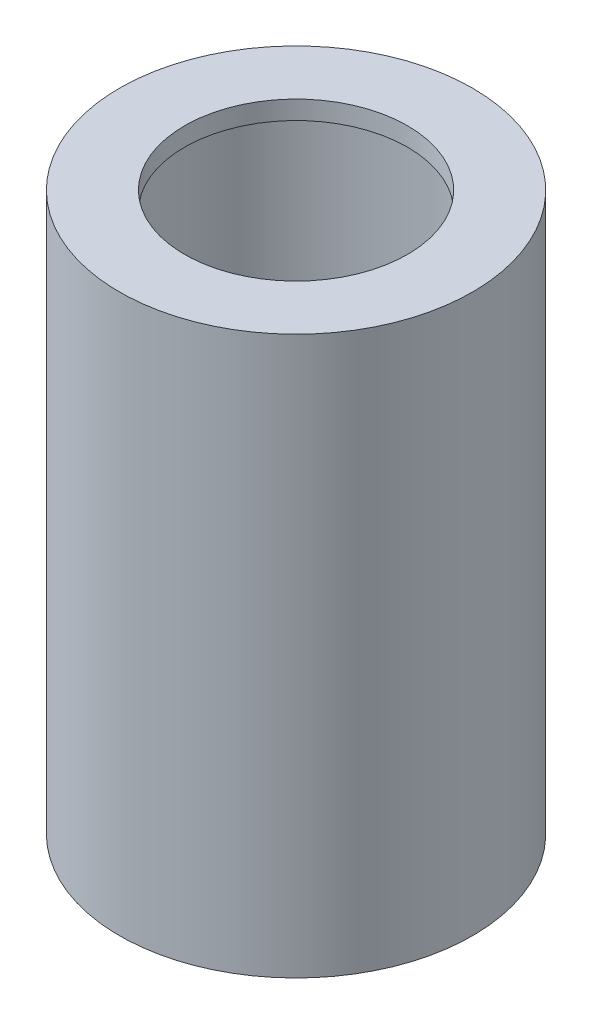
ISO-10303-21;
HEADER;
FILE_DESCRIPTION(('STEP AP214'),'2;1');
FILE_NAME('part.step','',(''),(''),'','','');
FILE_SCHEMA(('AUTOMOTIVE_DESIGN { 1 0 10303 214 1 1 1 1 }'));
ENDSEC;
DATA;
#1=APPLICATION_CONTEXT('core data for automotive mechanical design processes');
#2=APPLICATION_PROTOCOL_DEFINITION('international standard','automotive_design',2000,#1);
#3=PRODUCT_CONTEXT('',#1,'mechanical');
#4=PRODUCT('Part','Part','',(#3));
#5=PRODUCT_RELATED_PRODUCT_CATEGORY('part','',(#4));
#6=PRODUCT_DEFINITION_FORMATION('','',#4);
#7=PRODUCT_DEFINITION_CONTEXT('part definition',#1,'design');
#8=PRODUCT_DEFINITION('design','',#6,#7);
#9=PRODUCT_DEFINITION_SHAPE('','',#8);
#10=(LENGTH_UNIT() NAMED_UNIT(*) SI_UNIT(.MILLI.,.METRE.));
#11=(NAMED_UNIT(*) PLANE_ANGLE_UNIT() SI_UNIT($,.RADIAN.));
#12=(NAMED_UNIT(*) SI_UNIT($,.STERADIAN.) SOLID_ANGLE_UNIT());
#13=UNCERTAINTY_MEASURE_WITH_UNIT(LENGTH_MEASURE(1.E-05),#10,'distance_accuracy_value','');
#14=(GEOMETRIC_REPRESENTATION_CONTEXT(3) GLOBAL_UNCERTAINTY_ASSIGNED_CONTEXT((#13)) GLOBAL_UNIT_ASSIGNED_CONTEXT((#10,
#11,#12)) REPRESENTATION_CONTEXT('',''));
#15=CARTESIAN_POINT('',(0.,0.,0.));
#16=DIRECTION('',(0.,0.,1.));
#17=DIRECTION('',(1.,0.,0.));
#18=AXIS2_PLACEMENT_3D('',#15,#16,#17);
#19=CARTESIAN_POINT('',(0.,1.5,0.));
#20=DIRECTION('',(0.,-1.,0.));
#21=DIRECTION('',(0.,0.,-1.));
#22=AXIS2_PLACEMENT_3D('',#19,#20,#21);
#23=CYLINDRICAL_SURFACE('',#22,6.);
#24=CARTESIAN_POINT('',(0.,-1.,0.));
#25=DIRECTION('',(0.,-1.,0.));
#26=DIRECTION('',(0.,0.,-1.));
#27=AXIS2_PLACEMENT_3D('',#24,#25,#26);
#28=CIRCLE('',#27,6.);
#29=CARTESIAN_POINT('',(0.,-1.,-6.));
#30=VERTEX_POINT('',#29);
#31=EDGE_CURVE('E17',#30,#30,#28,.F.);
#32=ORIENTED_EDGE('',*,*,#31,.F.);
#33=EDGE_LOOP('',(#32));
#34=FACE_BOUND('',#33,.T.);
#35=CARTESIAN_POINT('',(0.,0.,0.));
#36=DIRECTION('',(0.,-1.,0.));
#37=DIRECTION('',(0.,0.,-1.));
#38=AXIS2_PLACEMENT_3D('',#35,#36,#37);
#39=CIRCLE('',#38,6.);
#40=CARTESIAN_POINT('',(0.,0.,-6.));
#41=VERTEX_POINT('',#40);
#42=EDGE_CURVE('E33',#41,#41,#39,.F.);
#43=ORIENTED_EDGE('',*,*,#42,.T.);
#44=EDGE_LOOP('',(#43));
#45=FACE_BOUND('',#44,.T.);
#46=ADVANCED_FACE('F14',(#34,#45),#23,.F.);
#47=CARTESIAN_POINT('',(0.,-1.,0.));
#48=DIRECTION('',(0.,-1.,0.));
#49=DIRECTION('',(0.,0.,-1.));
#50=AXIS2_PLACEMENT_3D('',#47,#48,#49);
#51=PLANE('',#50);
#52=ORIENTED_EDGE('',*,*,#31,.T.);
#53=EDGE_LOOP('',(#52));
#54=FACE_BOUND('',#53,.T.);
#55=CARTESIAN_POINT('',(0.,-1.,0.));
#56=DIRECTION('',(0.,-1.,0.));
#57=DIRECTION('',(0.,0.,-1.));
#58=AXIS2_PLACEMENT_3D('',#55,#56,#57);
#59=CIRCLE('',#58,8.);
#60=CARTESIAN_POINT('',(0.,-1.,-8.));
#61=VERTEX_POINT('',#60);
#62=EDGE_CURVE('E31',#61,#61,#59,.T.);
#63=ORIENTED_EDGE('',*,*,#62,.T.);
#64=EDGE_LOOP('',(#63));
#65=FACE_BOUND('',#64,.T.);
#66=ADVANCED_FACE('F40',(#54,#65),#51,.T.);
#67=CARTESIAN_POINT('',(0.,1.5,0.));
#68=DIRECTION('',(0.,-1.,0.));
#69=DIRECTION('',(0.,0.,-1.));
#70=AXIS2_PLACEMENT_3D('',#67,#68,#69);
#71=CYLINDRICAL_SURFACE('',#70,8.);
#72=CARTESIAN_POINT('',(0.,-30.,0.));
#73=DIRECTION('',(0.,-1.,0.));
#74=DIRECTION('',(0.,0.,-1.));
#75=AXIS2_PLACEMENT_3D('',#72,#73,#74);
#76=CIRCLE('',#75,8.);
#77=CARTESIAN_POINT('',(0.,-30.,-8.));
#78=VERTEX_POINT('',#77);
#79=EDGE_CURVE('E26',#78,#78,#76,.F.);
#80=ORIENTED_EDGE('',*,*,#79,.F.);
#81=EDGE_LOOP('',(#80));
#82=FACE_BOUND('',#81,.T.);
#83=ORIENTED_EDGE('',*,*,#62,.F.);
#84=EDGE_LOOP('',(#83));
#85=FACE_BOUND('',#84,.T.);
#86=ADVANCED_FACE('F49',(#82,#85),#71,.F.);
#87=CARTESIAN_POINT('',(0.,0.,0.));
#88=DIRECTION('',(0.,-1.,0.));
#89=DIRECTION('',(0.,0.,-1.));
#90=AXIS2_PLACEMENT_3D('',#87,#88,#89);
#91=PLANE('',#90);
#92=CARTESIAN_POINT('',(0.,0.,0.));
#93=DIRECTION('',(0.,-1.,0.));
#94=DIRECTION('',(0.,0.,-1.));
#95=AXIS2_PLACEMENT_3D('',#92,#93,#94);
#96=CIRCLE('',#95,9.5);
#97=CARTESIAN_POINT('',(0.,0.,-9.5));
#98=VERTEX_POINT('',#97);
#99=EDGE_CURVE('E21',#98,#98,#96,.T.);
#100=ORIENTED_EDGE('',*,*,#99,.F.);
#101=EDGE_LOOP('',(#100));
#102=FACE_BOUND('',#101,.T.);
#103=ORIENTED_EDGE('',*,*,#42,.F.);
#104=EDGE_LOOP('',(#103));
#105=FACE_BOUND('',#104,.T.);
#106=ADVANCED_FACE('F58',(#102,#105),#91,.F.);
#107=CARTESIAN_POINT('',(0.,-30.,0.));
#108=DIRECTION('',(0.,-1.,0.));
#109=DIRECTION('',(0.,0.,-1.));
#110=AXIS2_PLACEMENT_3D('',#107,#108,#109);
#111=PLANE('',#110);
#112=ORIENTED_EDGE('',*,*,#79,.T.);
#113=EDGE_LOOP('',(#112));
#114=FACE_BOUND('',#113,.T.);
#115=CARTESIAN_POINT('',(0.,-30.,0.));
#116=DIRECTION('',(0.,-1.,0.));
#117=DIRECTION('',(0.,0.,-1.));
#118=AXIS2_PLACEMENT_3D('',#115,#116,#117);
#119=CIRCLE('',#118,9.5);
#120=CARTESIAN_POINT('',(0.,-30.,-9.5));
#121=VERTEX_POINT('',#120);
#122=EDGE_CURVE('E10',#121,#121,#119,.F.);
#123=ORIENTED_EDGE('',*,*,#122,.F.);
#124=EDGE_LOOP('',(#123));
#125=FACE_BOUND('',#124,.T.);
#126=ADVANCED_FACE('F52',(#114,#125),#111,.T.);
#127=CARTESIAN_POINT('',(0.,1.5,0.));
#128=DIRECTION('',(0.,-1.,0.));
#129=DIRECTION('',(0.,0.,-1.));
#130=AXIS2_PLACEMENT_3D('',#127,#128,#129);
#131=CYLINDRICAL_SURFACE('',#130,9.5);
#132=ORIENTED_EDGE('',*,*,#122,.T.);
#133=EDGE_LOOP('',(#132));
#134=FACE_BOUND('',#133,.T.);
#135=ORIENTED_EDGE('',*,*,#99,.T.);
#136=EDGE_LOOP('',(#135));
#137=FACE_BOUND('',#136,.T.);
#138=ADVANCED_FACE('F50',(#134,#137),#131,.T.);
#139=CLOSED_SHELL('',(#46,#66,#86,#106,#126,#138));
#140=MANIFOLD_SOLID_BREP('B1',#139);
#141=ADVANCED_BREP_SHAPE_REPRESENTATION('',(#18,#140),#14);
#142=SHAPE_DEFINITION_REPRESENTATION(#9,#141);
ENDSEC;
END-ISO-10303-21;
